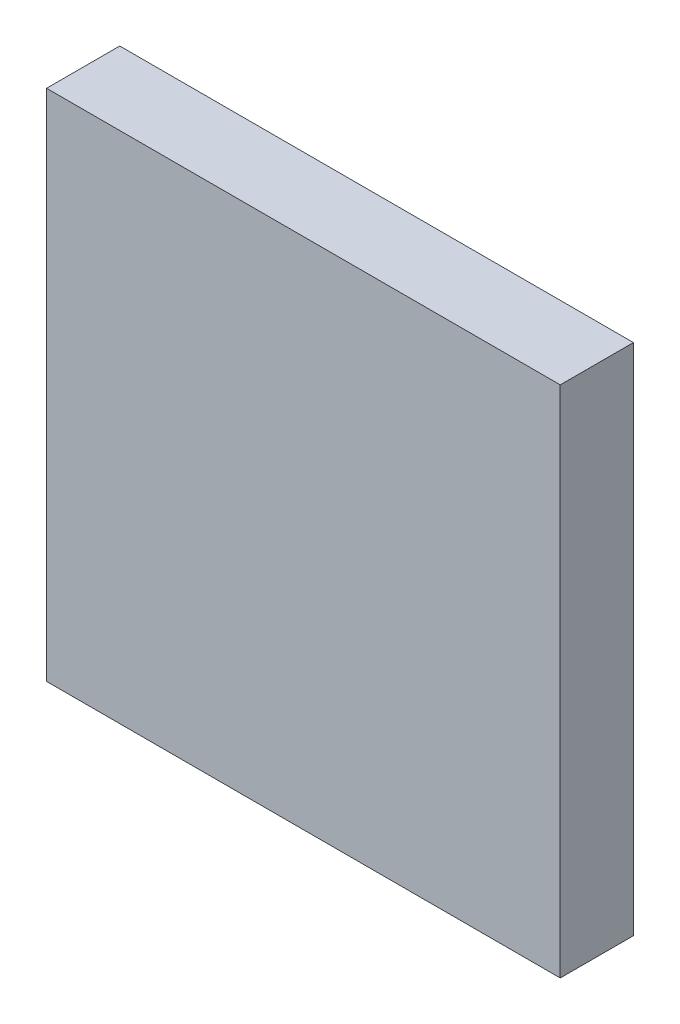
ISO-10303-21;
HEADER;
FILE_DESCRIPTION(('STEP AP214'),'2;1');
FILE_NAME('part.step','',(''),(''),'','','');
FILE_SCHEMA(('AUTOMOTIVE_DESIGN { 1 0 10303 214 1 1 1 1 }'));
ENDSEC;
DATA;
#1=APPLICATION_CONTEXT('core data for automotive mechanical design processes');
#2=APPLICATION_PROTOCOL_DEFINITION('international standard','automotive_design',2000,#1);
#3=PRODUCT_CONTEXT('',#1,'mechanical');
#4=PRODUCT('Part','Part','',(#3));
#5=PRODUCT_RELATED_PRODUCT_CATEGORY('part','',(#4));
#6=PRODUCT_DEFINITION_FORMATION('','',#4);
#7=PRODUCT_DEFINITION_CONTEXT('part definition',#1,'design');
#8=PRODUCT_DEFINITION('design','',#6,#7);
#9=PRODUCT_DEFINITION_SHAPE('','',#8);
#10=(LENGTH_UNIT() NAMED_UNIT(*) SI_UNIT(.MILLI.,.METRE.));
#11=(NAMED_UNIT(*) PLANE_ANGLE_UNIT() SI_UNIT($,.RADIAN.));
#12=(NAMED_UNIT(*) SI_UNIT($,.STERADIAN.) SOLID_ANGLE_UNIT());
#13=UNCERTAINTY_MEASURE_WITH_UNIT(LENGTH_MEASURE(1.E-05),#10,'distance_accuracy_value','');
#14=(GEOMETRIC_REPRESENTATION_CONTEXT(3) GLOBAL_UNCERTAINTY_ASSIGNED_CONTEXT((#13)) GLOBAL_UNIT_ASSIGNED_CONTEXT((#10,
#11,#12)) REPRESENTATION_CONTEXT('',''));
#15=CARTESIAN_POINT('',(0.,0.,0.));
#16=DIRECTION('',(0.,0.,1.));
#17=DIRECTION('',(1.,0.,0.));
#18=AXIS2_PLACEMENT_3D('',#15,#16,#17);
#19=CARTESIAN_POINT('',(234.256401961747,76.8166089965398,5.7));
#20=DIRECTION('',(1.,0.,0.));
#21=DIRECTION('',(0.,1.,0.));
#22=AXIS2_PLACEMENT_3D('',#19,#20,#21);
#23=PLANE('',#22);
#24=DIRECTION('',(0.,-1.,0.));
#25=VECTOR('',#24,1.);
#26=CARTESIAN_POINT('',(234.256401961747,76.8166089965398,0.));
#27=LINE('',#26,#25);
#28=CARTESIAN_POINT('',(234.256401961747,76.8166089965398,0.));
#29=VERTEX_POINT('',#28);
#30=CARTESIAN_POINT('',(234.256401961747,36.8166089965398,0.));
#31=VERTEX_POINT('',#30);
#32=EDGE_CURVE('E95',#29,#31,#27,.T.);
#33=ORIENTED_EDGE('',*,*,#32,.T.);
#34=DIRECTION('',(0.,0.,-1.));
#35=VECTOR('',#34,1.);
#36=CARTESIAN_POINT('',(234.256401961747,36.8166089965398,5.7));
#37=LINE('',#36,#35);
#38=CARTESIAN_POINT('',(234.256401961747,36.8166089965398,5.7));
#39=VERTEX_POINT('',#38);
#40=EDGE_CURVE('E11',#39,#31,#37,.T.);
#41=ORIENTED_EDGE('',*,*,#40,.F.);
#42=DIRECTION('',(0.,-1.,0.));
#43=VECTOR('',#42,1.);
#44=CARTESIAN_POINT('',(234.256401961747,76.8166089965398,5.7));
#45=LINE('',#44,#43);
#46=CARTESIAN_POINT('',(234.256401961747,76.8166089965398,5.7));
#47=VERTEX_POINT('',#46);
#48=EDGE_CURVE('E83',#47,#39,#45,.T.);
#49=ORIENTED_EDGE('',*,*,#48,.F.);
#50=DIRECTION('',(0.,0.,-1.));
#51=VECTOR('',#50,1.);
#52=CARTESIAN_POINT('',(234.256401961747,76.8166089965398,5.7));
#53=LINE('',#52,#51);
#54=EDGE_CURVE('E91',#47,#29,#53,.T.);
#55=ORIENTED_EDGE('',*,*,#54,.T.);
#56=EDGE_LOOP('',(#33,#41,#49,#55));
#57=FACE_BOUND('',#56,.T.);
#58=ADVANCED_FACE('F32',(#57),#23,.F.);
#59=CARTESIAN_POINT('',(234.256401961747,36.8166089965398,5.7));
#60=DIRECTION('',(0.,1.,0.));
#61=DIRECTION('',(0.,0.,1.));
#62=AXIS2_PLACEMENT_3D('',#59,#60,#61);
#63=PLANE('',#62);
#64=DIRECTION('',(1.,0.,0.));
#65=VECTOR('',#64,1.);
#66=CARTESIAN_POINT('',(234.256401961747,36.8166089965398,0.));
#67=LINE('',#66,#65);
#68=CARTESIAN_POINT('',(274.256401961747,36.8166089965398,0.));
#69=VERTEX_POINT('',#68);
#70=EDGE_CURVE('E87',#31,#69,#67,.T.);
#71=ORIENTED_EDGE('',*,*,#70,.T.);
#72=DIRECTION('',(0.,0.,-1.));
#73=VECTOR('',#72,1.);
#74=CARTESIAN_POINT('',(274.256401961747,36.8166089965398,5.7));
#75=LINE('',#74,#73);
#76=CARTESIAN_POINT('',(274.256401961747,36.8166089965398,5.7));
#77=VERTEX_POINT('',#76);
#78=EDGE_CURVE('E40',#77,#69,#75,.T.);
#79=ORIENTED_EDGE('',*,*,#78,.F.);
#80=DIRECTION('',(1.,0.,0.));
#81=VECTOR('',#80,1.);
#82=CARTESIAN_POINT('',(234.256401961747,36.8166089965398,5.7));
#83=LINE('',#82,#81);
#84=EDGE_CURVE('E78',#39,#77,#83,.T.);
#85=ORIENTED_EDGE('',*,*,#84,.F.);
#86=ORIENTED_EDGE('',*,*,#40,.T.);
#87=EDGE_LOOP('',(#71,#79,#85,#86));
#88=FACE_BOUND('',#87,.T.);
#89=ADVANCED_FACE('F86',(#88),#63,.F.);
#90=CARTESIAN_POINT('',(274.256401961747,76.8166089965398,5.7));
#91=DIRECTION('',(-1.,0.,0.));
#92=DIRECTION('',(0.,-1.,0.));
#93=AXIS2_PLACEMENT_3D('',#90,#91,#92);
#94=PLANE('',#93);
#95=DIRECTION('',(0.,1.,0.));
#96=VECTOR('',#95,1.);
#97=CARTESIAN_POINT('',(274.256401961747,76.8166089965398,0.));
#98=LINE('',#97,#96);
#99=CARTESIAN_POINT('',(274.256401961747,76.8166089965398,0.));
#100=VERTEX_POINT('',#99);
#101=EDGE_CURVE('E65',#69,#100,#98,.T.);
#102=ORIENTED_EDGE('',*,*,#101,.T.);
#103=DIRECTION('',(0.,0.,-1.));
#104=VECTOR('',#103,1.);
#105=CARTESIAN_POINT('',(274.256401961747,76.8166089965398,5.7));
#106=LINE('',#105,#104);
#107=CARTESIAN_POINT('',(274.256401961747,76.8166089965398,5.7));
#108=VERTEX_POINT('',#107);
#109=EDGE_CURVE('E88',#108,#100,#106,.T.);
#110=ORIENTED_EDGE('',*,*,#109,.F.);
#111=DIRECTION('',(0.,1.,0.));
#112=VECTOR('',#111,1.);
#113=CARTESIAN_POINT('',(274.256401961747,76.8166089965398,5.7));
#114=LINE('',#113,#112);
#115=EDGE_CURVE('E81',#77,#108,#114,.T.);
#116=ORIENTED_EDGE('',*,*,#115,.F.);
#117=ORIENTED_EDGE('',*,*,#78,.T.);
#118=EDGE_LOOP('',(#102,#110,#116,#117));
#119=FACE_BOUND('',#118,.T.);
#120=ADVANCED_FACE('F89',(#119),#94,.F.);
#121=CARTESIAN_POINT('',(234.256401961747,76.8166089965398,5.7));
#122=DIRECTION('',(0.,-1.,0.));
#123=DIRECTION('',(0.,0.,-1.));
#124=AXIS2_PLACEMENT_3D('',#121,#122,#123);
#125=PLANE('',#124);
#126=DIRECTION('',(-1.,0.,0.));
#127=VECTOR('',#126,1.);
#128=CARTESIAN_POINT('',(234.256401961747,76.8166089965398,0.));
#129=LINE('',#128,#127);
#130=EDGE_CURVE('E71',#100,#29,#129,.T.);
#131=ORIENTED_EDGE('',*,*,#130,.T.);
#132=ORIENTED_EDGE('',*,*,#54,.F.);
#133=DIRECTION('',(-1.,0.,0.));
#134=VECTOR('',#133,1.);
#135=CARTESIAN_POINT('',(234.256401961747,76.8166089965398,5.7));
#136=LINE('',#135,#134);
#137=EDGE_CURVE('E48',#108,#47,#136,.T.);
#138=ORIENTED_EDGE('',*,*,#137,.F.);
#139=ORIENTED_EDGE('',*,*,#109,.T.);
#140=EDGE_LOOP('',(#131,#132,#138,#139));
#141=FACE_BOUND('',#140,.T.);
#142=ADVANCED_FACE('F102',(#141),#125,.F.);
#143=CARTESIAN_POINT('',(0.,0.,5.7));
#144=DIRECTION('',(0.,0.,1.));
#145=DIRECTION('',(1.,0.,0.));
#146=AXIS2_PLACEMENT_3D('',#143,#144,#145);
#147=PLANE('',#146);
#148=ORIENTED_EDGE('',*,*,#48,.T.);
#149=ORIENTED_EDGE('',*,*,#84,.T.);
#150=ORIENTED_EDGE('',*,*,#115,.T.);
#151=ORIENTED_EDGE('',*,*,#137,.T.);
#152=EDGE_LOOP('',(#148,#149,#150,#151));
#153=FACE_BOUND('',#152,.T.);
#154=ADVANCED_FACE('F79',(#153),#147,.T.);
#155=CARTESIAN_POINT('',(0.,0.,0.));
#156=DIRECTION('',(0.,0.,1.));
#157=DIRECTION('',(1.,0.,0.));
#158=AXIS2_PLACEMENT_3D('',#155,#156,#157);
#159=PLANE('',#158);
#160=ORIENTED_EDGE('',*,*,#32,.F.);
#161=ORIENTED_EDGE('',*,*,#130,.F.);
#162=ORIENTED_EDGE('',*,*,#101,.F.);
#163=ORIENTED_EDGE('',*,*,#70,.F.);
#164=EDGE_LOOP('',(#160,#161,#162,#163));
#165=FACE_BOUND('',#164,.T.);
#166=ADVANCED_FACE('F105',(#165),#159,.F.);
#167=CLOSED_SHELL('',(#58,#89,#120,#142,#154,#166));
#168=MANIFOLD_SOLID_BREP('B2',#167);
#169=ADVANCED_BREP_SHAPE_REPRESENTATION('',(#18,#168),#14);
#170=SHAPE_DEFINITION_REPRESENTATION(#9,#169);
ENDSEC;
END-ISO-10303-21;
